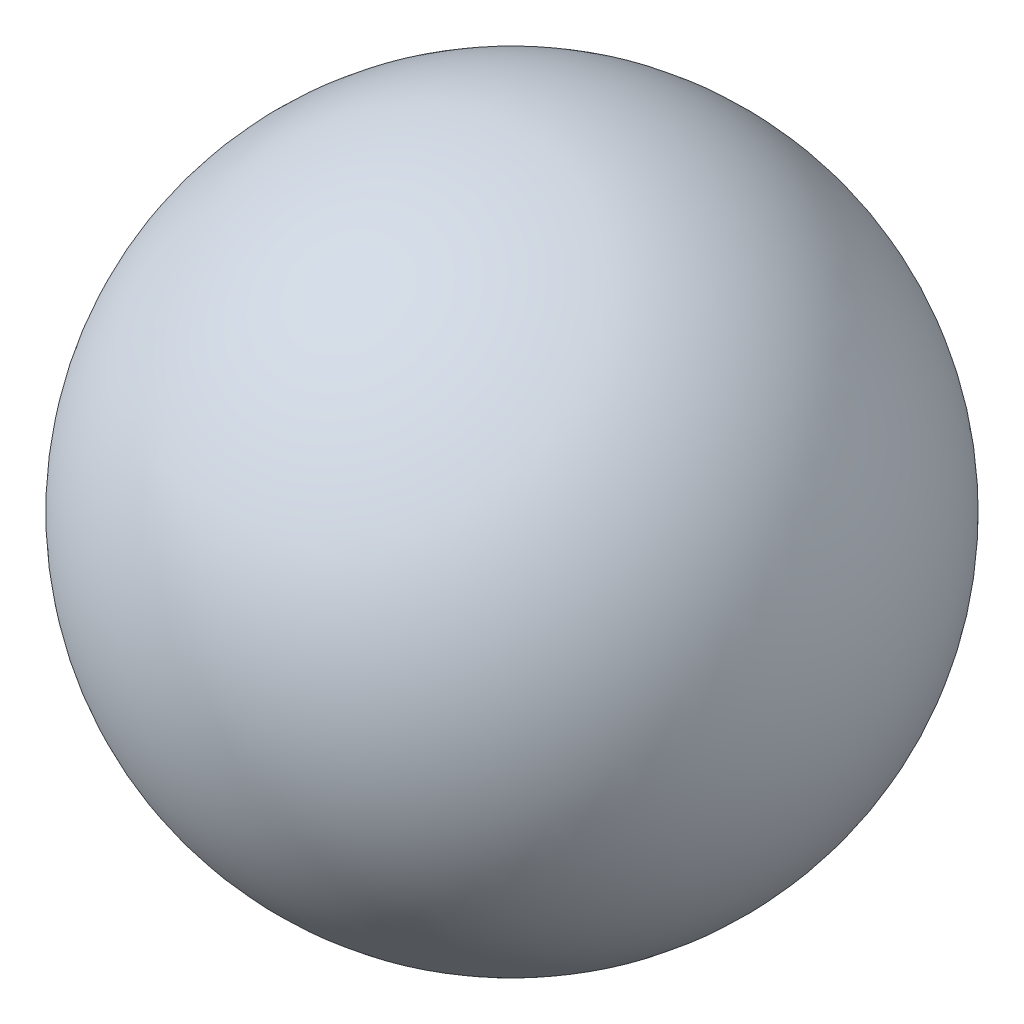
from build123d import *


with BuildPart() as part:
    # Sketch1 → Revolve1 (revolve)
    with BuildSketch(Plane.XY):
        with BuildLine():
            Line((0, -2.5), (0, 2.5))
            ThreePointArc((0, 2.5), (2.5, 0), (0, -2.5))
        make_face()
    revolve(axis=Axis((0, -2.5, 0), (0, 1, 0)))


solid = part.part
